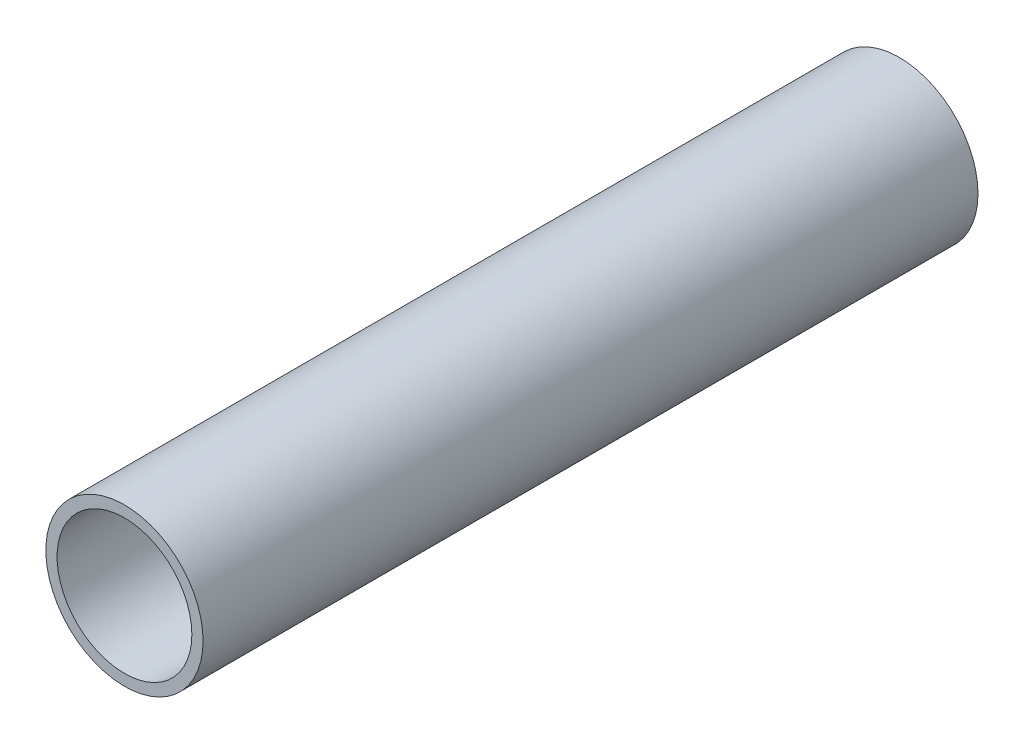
from build123d import *

# Parameters (mm, degrees)
ESQUISSE1_R      = 7
ESQUISSE1_R_2    = 6
EXTRUSION1_DEPTH = 69


with BuildPart() as part:
    # Esquisse1 → Extrusion1 (new body)
    with BuildSketch(Plane.XY):
        Circle(ESQUISSE1_R)
        Circle(ESQUISSE1_R_2, mode=Mode.SUBTRACT)
    extrude(amount=EXTRUSION1_DEPTH)


solid = part.part
